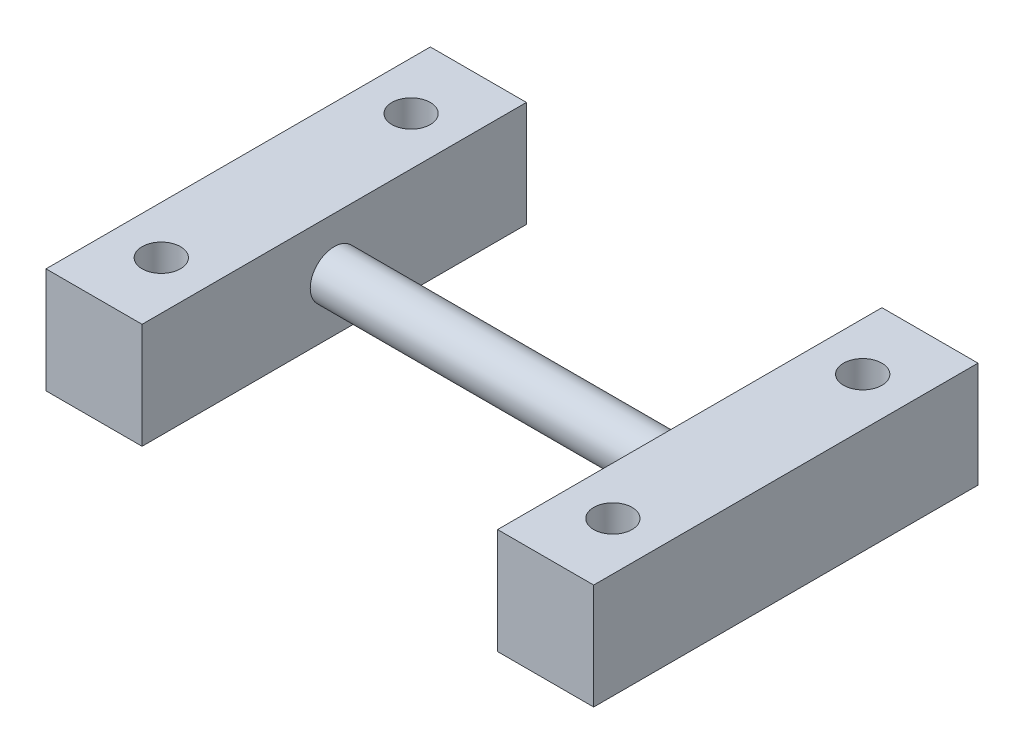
ISO-10303-21;
HEADER;
FILE_DESCRIPTION(('STEP AP214'),'2;1');
FILE_NAME('part.step','',(''),(''),'','','');
FILE_SCHEMA(('AUTOMOTIVE_DESIGN { 1 0 10303 214 1 1 1 1 }'));
ENDSEC;
DATA;
#1=APPLICATION_CONTEXT('core data for automotive mechanical design processes');
#2=APPLICATION_PROTOCOL_DEFINITION('international standard','automotive_design',2000,#1);
#3=PRODUCT_CONTEXT('',#1,'mechanical');
#4=PRODUCT('Part','Part','',(#3));
#5=PRODUCT_RELATED_PRODUCT_CATEGORY('part','',(#4));
#6=PRODUCT_DEFINITION_FORMATION('','',#4);
#7=PRODUCT_DEFINITION_CONTEXT('part definition',#1,'design');
#8=PRODUCT_DEFINITION('design','',#6,#7);
#9=PRODUCT_DEFINITION_SHAPE('','',#8);
#10=(LENGTH_UNIT() NAMED_UNIT(*) SI_UNIT(.MILLI.,.METRE.));
#11=(NAMED_UNIT(*) PLANE_ANGLE_UNIT() SI_UNIT($,.RADIAN.));
#12=(NAMED_UNIT(*) SI_UNIT($,.STERADIAN.) SOLID_ANGLE_UNIT());
#13=UNCERTAINTY_MEASURE_WITH_UNIT(LENGTH_MEASURE(1.E-05),#10,'distance_accuracy_value','');
#14=(GEOMETRIC_REPRESENTATION_CONTEXT(3) GLOBAL_UNCERTAINTY_ASSIGNED_CONTEXT((#13)) GLOBAL_UNIT_ASSIGNED_CONTEXT((#10,
#11,#12)) REPRESENTATION_CONTEXT('',''));
#15=CARTESIAN_POINT('',(0.,0.,0.));
#16=DIRECTION('',(0.,0.,1.));
#17=DIRECTION('',(1.,0.,0.));
#18=AXIS2_PLACEMENT_3D('',#15,#16,#17);
#19=CARTESIAN_POINT('',(0.,22.,0.));
#20=DIRECTION('',(1.,0.,0.));
#21=DIRECTION('',(0.,0.,-1.));
#22=AXIS2_PLACEMENT_3D('',#19,#20,#21);
#23=PLANE('',#22);
#24=DIRECTION('',(0.,0.,-1.));
#25=VECTOR('',#24,1.);
#26=CARTESIAN_POINT('',(0.,11.,40.));
#27=LINE('',#26,#25);
#28=CARTESIAN_POINT('',(0.,11.,40.));
#29=VERTEX_POINT('',#28);
#30=CARTESIAN_POINT('',(0.,11.,0.));
#31=VERTEX_POINT('',#30);
#32=EDGE_CURVE('E51',#29,#31,#27,.T.);
#33=ORIENTED_EDGE('',*,*,#32,.F.);
#34=DIRECTION('',(0.,-1.,0.));
#35=VECTOR('',#34,1.);
#36=CARTESIAN_POINT('',(0.,22.,40.));
#37=LINE('',#36,#35);
#38=CARTESIAN_POINT('',(0.,22.,40.));
#39=VERTEX_POINT('',#38);
#40=EDGE_CURVE('E44',#39,#29,#37,.T.);
#41=ORIENTED_EDGE('',*,*,#40,.F.);
#42=DIRECTION('',(0.,0.,1.));
#43=VECTOR('',#42,1.);
#44=CARTESIAN_POINT('',(0.,22.,0.));
#45=LINE('',#44,#43);
#46=CARTESIAN_POINT('',(0.,22.,0.));
#47=VERTEX_POINT('',#46);
#48=EDGE_CURVE('E140',#47,#39,#45,.T.);
#49=ORIENTED_EDGE('',*,*,#48,.F.);
#50=DIRECTION('',(0.,-1.,0.));
#51=VECTOR('',#50,1.);
#52=CARTESIAN_POINT('',(0.,22.,0.));
#53=LINE('',#52,#51);
#54=EDGE_CURVE('E149',#47,#31,#53,.T.);
#55=ORIENTED_EDGE('',*,*,#54,.T.);
#56=EDGE_LOOP('',(#33,#41,#49,#55));
#57=FACE_BOUND('',#56,.T.);
#58=ADVANCED_FACE('F36',(#57),#23,.F.);
#59=CARTESIAN_POINT('',(0.,22.,40.));
#60=DIRECTION('',(0.,0.,-1.));
#61=DIRECTION('',(-1.,0.,0.));
#62=AXIS2_PLACEMENT_3D('',#59,#60,#61);
#63=PLANE('',#62);
#64=DIRECTION('',(-1.,0.,0.));
#65=VECTOR('',#64,1.);
#66=CARTESIAN_POINT('',(0.,11.,40.));
#67=LINE('',#66,#65);
#68=CARTESIAN_POINT('',(10.,11.,40.));
#69=VERTEX_POINT('',#68);
#70=EDGE_CURVE('E118',#69,#29,#67,.T.);
#71=ORIENTED_EDGE('',*,*,#70,.F.);
#72=DIRECTION('',(0.,-1.,0.));
#73=VECTOR('',#72,1.);
#74=CARTESIAN_POINT('',(10.,22.,40.));
#75=LINE('',#74,#73);
#76=CARTESIAN_POINT('',(10.,22.,40.));
#77=VERTEX_POINT('',#76);
#78=EDGE_CURVE('E155',#77,#69,#75,.T.);
#79=ORIENTED_EDGE('',*,*,#78,.F.);
#80=DIRECTION('',(1.,0.,0.));
#81=VECTOR('',#80,1.);
#82=CARTESIAN_POINT('',(0.,22.,40.));
#83=LINE('',#82,#81);
#84=EDGE_CURVE('E143',#39,#77,#83,.T.);
#85=ORIENTED_EDGE('',*,*,#84,.F.);
#86=ORIENTED_EDGE('',*,*,#40,.T.);
#87=EDGE_LOOP('',(#71,#79,#85,#86));
#88=FACE_BOUND('',#87,.T.);
#89=ADVANCED_FACE('F162',(#88),#63,.F.);
#90=CARTESIAN_POINT('',(10.,22.,0.));
#91=DIRECTION('',(-1.,0.,0.));
#92=DIRECTION('',(0.,0.,1.));
#93=AXIS2_PLACEMENT_3D('',#90,#91,#92);
#94=PLANE('',#93);
#95=CARTESIAN_POINT('',(10.,16.5,20.));
#96=DIRECTION('',(-1.,0.,0.));
#97=DIRECTION('',(0.,0.,1.));
#98=AXIS2_PLACEMENT_3D('',#95,#96,#97);
#99=CIRCLE('',#98,2.5);
#100=CARTESIAN_POINT('',(10.,16.5,22.5));
#101=VERTEX_POINT('',#100);
#102=EDGE_CURVE('E11',#101,#101,#99,.F.);
#103=ORIENTED_EDGE('',*,*,#102,.F.);
#104=EDGE_LOOP('',(#103));
#105=FACE_BOUND('',#104,.T.);
#106=DIRECTION('',(0.,0.,1.));
#107=VECTOR('',#106,1.);
#108=CARTESIAN_POINT('',(10.,11.,0.));
#109=LINE('',#108,#107);
#110=CARTESIAN_POINT('',(10.,11.,0.));
#111=VERTEX_POINT('',#110);
#112=EDGE_CURVE('E181',#111,#69,#109,.T.);
#113=ORIENTED_EDGE('',*,*,#112,.F.);
#114=DIRECTION('',(0.,-1.,0.));
#115=VECTOR('',#114,1.);
#116=CARTESIAN_POINT('',(10.,22.,0.));
#117=LINE('',#116,#115);
#118=CARTESIAN_POINT('',(10.,22.,0.));
#119=VERTEX_POINT('',#118);
#120=EDGE_CURVE('E152',#119,#111,#117,.T.);
#121=ORIENTED_EDGE('',*,*,#120,.F.);
#122=DIRECTION('',(0.,0.,-1.));
#123=VECTOR('',#122,1.);
#124=CARTESIAN_POINT('',(10.,22.,0.));
#125=LINE('',#124,#123);
#126=EDGE_CURVE('E145',#77,#119,#125,.T.);
#127=ORIENTED_EDGE('',*,*,#126,.F.);
#128=ORIENTED_EDGE('',*,*,#78,.T.);
#129=EDGE_LOOP('',(#113,#121,#127,#128));
#130=FACE_BOUND('',#129,.T.);
#131=ADVANCED_FACE('F218',(#105,#130),#94,.F.);
#132=CARTESIAN_POINT('',(0.,22.,0.));
#133=DIRECTION('',(0.,0.,1.));
#134=DIRECTION('',(1.,0.,0.));
#135=AXIS2_PLACEMENT_3D('',#132,#133,#134);
#136=PLANE('',#135);
#137=DIRECTION('',(1.,0.,0.));
#138=VECTOR('',#137,1.);
#139=CARTESIAN_POINT('',(0.,11.,0.));
#140=LINE('',#139,#138);
#141=EDGE_CURVE('E107',#31,#111,#140,.T.);
#142=ORIENTED_EDGE('',*,*,#141,.F.);
#143=ORIENTED_EDGE('',*,*,#54,.F.);
#144=DIRECTION('',(-1.,0.,0.));
#145=VECTOR('',#144,1.);
#146=CARTESIAN_POINT('',(0.,22.,0.));
#147=LINE('',#146,#145);
#148=EDGE_CURVE('E147',#119,#47,#147,.T.);
#149=ORIENTED_EDGE('',*,*,#148,.F.);
#150=ORIENTED_EDGE('',*,*,#120,.T.);
#151=EDGE_LOOP('',(#142,#143,#149,#150));
#152=FACE_BOUND('',#151,.T.);
#153=ADVANCED_FACE('F222',(#152),#136,.F.);
#154=CARTESIAN_POINT('',(5.,22.,7.));
#155=DIRECTION('',(0.,-1.,0.));
#156=DIRECTION('',(0.,0.,-1.));
#157=AXIS2_PLACEMENT_3D('',#154,#155,#156);
#158=CYLINDRICAL_SURFACE('',#157,2.);
#159=CARTESIAN_POINT('',(5.,22.,7.));
#160=DIRECTION('',(0.,1.,0.));
#161=DIRECTION('',(0.,0.,1.));
#162=AXIS2_PLACEMENT_3D('',#159,#160,#161);
#163=CIRCLE('',#162,2.);
#164=CARTESIAN_POINT('',(5.,22.,9.));
#165=VERTEX_POINT('',#164);
#166=EDGE_CURVE('E137',#165,#165,#163,.T.);
#167=ORIENTED_EDGE('',*,*,#166,.T.);
#168=EDGE_LOOP('',(#167));
#169=FACE_BOUND('',#168,.T.);
#170=CARTESIAN_POINT('',(5.,11.,7.));
#171=DIRECTION('',(0.,-1.,0.));
#172=DIRECTION('',(0.,0.,-1.));
#173=AXIS2_PLACEMENT_3D('',#170,#171,#172);
#174=CIRCLE('',#173,2.);
#175=CARTESIAN_POINT('',(5.,11.,5.));
#176=VERTEX_POINT('',#175);
#177=EDGE_CURVE('E178',#176,#176,#174,.T.);
#178=ORIENTED_EDGE('',*,*,#177,.T.);
#179=EDGE_LOOP('',(#178));
#180=FACE_BOUND('',#179,.T.);
#181=ADVANCED_FACE('F228',(#169,#180),#158,.F.);
#182=CARTESIAN_POINT('',(5.,22.,33.));
#183=DIRECTION('',(0.,-1.,0.));
#184=DIRECTION('',(0.,0.,-1.));
#185=AXIS2_PLACEMENT_3D('',#182,#183,#184);
#186=CYLINDRICAL_SURFACE('',#185,2.);
#187=CARTESIAN_POINT('',(5.,22.,33.));
#188=DIRECTION('',(0.,1.,0.));
#189=DIRECTION('',(0.,0.,1.));
#190=AXIS2_PLACEMENT_3D('',#187,#188,#189);
#191=CIRCLE('',#190,2.);
#192=CARTESIAN_POINT('',(5.,22.,35.));
#193=VERTEX_POINT('',#192);
#194=EDGE_CURVE('E134',#193,#193,#191,.T.);
#195=ORIENTED_EDGE('',*,*,#194,.T.);
#196=EDGE_LOOP('',(#195));
#197=FACE_BOUND('',#196,.T.);
#198=CARTESIAN_POINT('',(5.,11.,33.));
#199=DIRECTION('',(0.,-1.,0.));
#200=DIRECTION('',(0.,0.,-1.));
#201=AXIS2_PLACEMENT_3D('',#198,#199,#200);
#202=CIRCLE('',#201,2.);
#203=CARTESIAN_POINT('',(5.,11.,31.));
#204=VERTEX_POINT('',#203);
#205=EDGE_CURVE('E175',#204,#204,#202,.T.);
#206=ORIENTED_EDGE('',*,*,#205,.T.);
#207=EDGE_LOOP('',(#206));
#208=FACE_BOUND('',#207,.T.);
#209=ADVANCED_FACE('F211',(#197,#208),#186,.F.);
#210=CARTESIAN_POINT('',(47.,22.,0.));
#211=DIRECTION('',(1.,0.,0.));
#212=DIRECTION('',(0.,0.,-1.));
#213=AXIS2_PLACEMENT_3D('',#210,#211,#212);
#214=PLANE('',#213);
#215=CARTESIAN_POINT('',(47.,16.5,20.));
#216=DIRECTION('',(1.,0.,0.));
#217=DIRECTION('',(0.,0.,-1.));
#218=AXIS2_PLACEMENT_3D('',#215,#216,#217);
#219=CIRCLE('',#218,2.5);
#220=CARTESIAN_POINT('',(47.,16.5,17.5));
#221=VERTEX_POINT('',#220);
#222=EDGE_CURVE('E131',#221,#221,#219,.T.);
#223=ORIENTED_EDGE('',*,*,#222,.T.);
#224=EDGE_LOOP('',(#223));
#225=FACE_BOUND('',#224,.T.);
#226=DIRECTION('',(0.,0.,-1.));
#227=VECTOR('',#226,1.);
#228=CARTESIAN_POINT('',(47.,11.,0.));
#229=LINE('',#228,#227);
#230=CARTESIAN_POINT('',(47.,11.,40.));
#231=VERTEX_POINT('',#230);
#232=CARTESIAN_POINT('',(47.,11.,0.));
#233=VERTEX_POINT('',#232);
#234=EDGE_CURVE('E59',#231,#233,#229,.T.);
#235=ORIENTED_EDGE('',*,*,#234,.F.);
#236=DIRECTION('',(0.,-1.,0.));
#237=VECTOR('',#236,1.);
#238=CARTESIAN_POINT('',(47.,22.,40.));
#239=LINE('',#238,#237);
#240=CARTESIAN_POINT('',(47.,22.,40.));
#241=VERTEX_POINT('',#240);
#242=EDGE_CURVE('E124',#241,#231,#239,.T.);
#243=ORIENTED_EDGE('',*,*,#242,.F.);
#244=DIRECTION('',(0.,0.,1.));
#245=VECTOR('',#244,1.);
#246=CARTESIAN_POINT('',(47.,22.,0.));
#247=LINE('',#246,#245);
#248=CARTESIAN_POINT('',(47.,22.,0.));
#249=VERTEX_POINT('',#248);
#250=EDGE_CURVE('E189',#249,#241,#247,.T.);
#251=ORIENTED_EDGE('',*,*,#250,.F.);
#252=DIRECTION('',(0.,-1.,0.));
#253=VECTOR('',#252,1.);
#254=CARTESIAN_POINT('',(47.,22.,0.));
#255=LINE('',#254,#253);
#256=EDGE_CURVE('E122',#249,#233,#255,.T.);
#257=ORIENTED_EDGE('',*,*,#256,.T.);
#258=EDGE_LOOP('',(#235,#243,#251,#257));
#259=FACE_BOUND('',#258,.T.);
#260=ADVANCED_FACE('F201',(#225,#259),#214,.F.);
#261=CARTESIAN_POINT('',(47.,22.,40.));
#262=DIRECTION('',(0.,0.,-1.));
#263=DIRECTION('',(-1.,0.,0.));
#264=AXIS2_PLACEMENT_3D('',#261,#262,#263);
#265=PLANE('',#264);
#266=CARTESIAN_POINT('',(57.,11.,40.));
#267=VERTEX_POINT('',#266);
#268=EDGE_CURVE('E169',#267,#231,#67,.T.);
#269=ORIENTED_EDGE('',*,*,#268,.F.);
#270=DIRECTION('',(0.,-1.,0.));
#271=VECTOR('',#270,1.);
#272=CARTESIAN_POINT('',(57.,22.,40.));
#273=LINE('',#272,#271);
#274=CARTESIAN_POINT('',(57.,22.,40.));
#275=VERTEX_POINT('',#274);
#276=EDGE_CURVE('E117',#275,#267,#273,.T.);
#277=ORIENTED_EDGE('',*,*,#276,.F.);
#278=DIRECTION('',(1.,0.,0.));
#279=VECTOR('',#278,1.);
#280=CARTESIAN_POINT('',(47.,22.,40.));
#281=LINE('',#280,#279);
#282=EDGE_CURVE('E192',#241,#275,#281,.T.);
#283=ORIENTED_EDGE('',*,*,#282,.F.);
#284=ORIENTED_EDGE('',*,*,#242,.T.);
#285=EDGE_LOOP('',(#269,#277,#283,#284));
#286=FACE_BOUND('',#285,.T.);
#287=ADVANCED_FACE('F203',(#286),#265,.F.);
#288=CARTESIAN_POINT('',(57.,22.,0.));
#289=DIRECTION('',(-1.,0.,0.));
#290=DIRECTION('',(0.,0.,1.));
#291=AXIS2_PLACEMENT_3D('',#288,#289,#290);
#292=PLANE('',#291);
#293=DIRECTION('',(0.,0.,1.));
#294=VECTOR('',#293,1.);
#295=CARTESIAN_POINT('',(57.,11.,40.));
#296=LINE('',#295,#294);
#297=CARTESIAN_POINT('',(57.,11.,0.));
#298=VERTEX_POINT('',#297);
#299=EDGE_CURVE('E101',#298,#267,#296,.T.);
#300=ORIENTED_EDGE('',*,*,#299,.F.);
#301=DIRECTION('',(0.,-1.,0.));
#302=VECTOR('',#301,1.);
#303=CARTESIAN_POINT('',(57.,22.,0.));
#304=LINE('',#303,#302);
#305=CARTESIAN_POINT('',(57.,22.,0.));
#306=VERTEX_POINT('',#305);
#307=EDGE_CURVE('E114',#306,#298,#304,.T.);
#308=ORIENTED_EDGE('',*,*,#307,.F.);
#309=DIRECTION('',(0.,0.,-1.));
#310=VECTOR('',#309,1.);
#311=CARTESIAN_POINT('',(57.,22.,0.));
#312=LINE('',#311,#310);
#313=EDGE_CURVE('E194',#275,#306,#312,.T.);
#314=ORIENTED_EDGE('',*,*,#313,.F.);
#315=ORIENTED_EDGE('',*,*,#276,.T.);
#316=EDGE_LOOP('',(#300,#308,#314,#315));
#317=FACE_BOUND('',#316,.T.);
#318=ADVANCED_FACE('F112',(#317),#292,.F.);
#319=CARTESIAN_POINT('',(47.,22.,0.));
#320=DIRECTION('',(0.,0.,1.));
#321=DIRECTION('',(1.,0.,0.));
#322=AXIS2_PLACEMENT_3D('',#319,#320,#321);
#323=PLANE('',#322);
#324=EDGE_CURVE('E98',#233,#298,#140,.T.);
#325=ORIENTED_EDGE('',*,*,#324,.F.);
#326=ORIENTED_EDGE('',*,*,#256,.F.);
#327=DIRECTION('',(-1.,0.,0.));
#328=VECTOR('',#327,1.);
#329=CARTESIAN_POINT('',(47.,22.,0.));
#330=LINE('',#329,#328);
#331=EDGE_CURVE('E121',#306,#249,#330,.T.);
#332=ORIENTED_EDGE('',*,*,#331,.F.);
#333=ORIENTED_EDGE('',*,*,#307,.T.);
#334=EDGE_LOOP('',(#325,#326,#332,#333));
#335=FACE_BOUND('',#334,.T.);
#336=ADVANCED_FACE('F120',(#335),#323,.F.);
#337=CARTESIAN_POINT('',(52.,22.,7.));
#338=DIRECTION('',(0.,-1.,0.));
#339=DIRECTION('',(0.,0.,-1.));
#340=AXIS2_PLACEMENT_3D('',#337,#338,#339);
#341=CYLINDRICAL_SURFACE('',#340,2.);
#342=CARTESIAN_POINT('',(52.,22.,7.));
#343=DIRECTION('',(0.,1.,0.));
#344=DIRECTION('',(0.,0.,1.));
#345=AXIS2_PLACEMENT_3D('',#342,#343,#344);
#346=CIRCLE('',#345,2.);
#347=CARTESIAN_POINT('',(52.,22.,9.));
#348=VERTEX_POINT('',#347);
#349=EDGE_CURVE('E186',#348,#348,#346,.T.);
#350=ORIENTED_EDGE('',*,*,#349,.T.);
#351=EDGE_LOOP('',(#350));
#352=FACE_BOUND('',#351,.T.);
#353=CARTESIAN_POINT('',(52.,11.,7.));
#354=DIRECTION('',(0.,-1.,0.));
#355=DIRECTION('',(0.,0.,-1.));
#356=AXIS2_PLACEMENT_3D('',#353,#354,#355);
#357=CIRCLE('',#356,2.);
#358=CARTESIAN_POINT('',(52.,11.,5.00000000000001));
#359=VERTEX_POINT('',#358);
#360=EDGE_CURVE('E171',#359,#359,#357,.T.);
#361=ORIENTED_EDGE('',*,*,#360,.T.);
#362=EDGE_LOOP('',(#361));
#363=FACE_BOUND('',#362,.T.);
#364=ADVANCED_FACE('F276',(#352,#363),#341,.F.);
#365=CARTESIAN_POINT('',(52.,22.,33.));
#366=DIRECTION('',(0.,-1.,0.));
#367=DIRECTION('',(0.,0.,-1.));
#368=AXIS2_PLACEMENT_3D('',#365,#366,#367);
#369=CYLINDRICAL_SURFACE('',#368,2.);
#370=CARTESIAN_POINT('',(52.,22.,33.));
#371=DIRECTION('',(0.,1.,0.));
#372=DIRECTION('',(0.,0.,1.));
#373=AXIS2_PLACEMENT_3D('',#370,#371,#372);
#374=CIRCLE('',#373,2.);
#375=CARTESIAN_POINT('',(52.,22.,35.));
#376=VERTEX_POINT('',#375);
#377=EDGE_CURVE('E183',#376,#376,#374,.T.);
#378=ORIENTED_EDGE('',*,*,#377,.T.);
#379=EDGE_LOOP('',(#378));
#380=FACE_BOUND('',#379,.T.);
#381=CARTESIAN_POINT('',(52.,11.,33.));
#382=DIRECTION('',(0.,-1.,0.));
#383=DIRECTION('',(0.,0.,-1.));
#384=AXIS2_PLACEMENT_3D('',#381,#382,#383);
#385=CIRCLE('',#384,2.);
#386=CARTESIAN_POINT('',(52.,11.,31.));
#387=VERTEX_POINT('',#386);
#388=EDGE_CURVE('E39',#387,#387,#385,.T.);
#389=ORIENTED_EDGE('',*,*,#388,.T.);
#390=EDGE_LOOP('',(#389));
#391=FACE_BOUND('',#390,.T.);
#392=ADVANCED_FACE('F234',(#380,#391),#369,.F.);
#393=CARTESIAN_POINT('',(0.,22.,0.));
#394=DIRECTION('',(0.,1.,0.));
#395=DIRECTION('',(0.,0.,1.));
#396=AXIS2_PLACEMENT_3D('',#393,#394,#395);
#397=PLANE('',#396);
#398=ORIENTED_EDGE('',*,*,#166,.F.);
#399=EDGE_LOOP('',(#398));
#400=FACE_BOUND('',#399,.T.);
#401=ORIENTED_EDGE('',*,*,#48,.T.);
#402=ORIENTED_EDGE('',*,*,#84,.T.);
#403=ORIENTED_EDGE('',*,*,#126,.T.);
#404=ORIENTED_EDGE('',*,*,#148,.T.);
#405=EDGE_LOOP('',(#401,#402,#403,#404));
#406=FACE_BOUND('',#405,.T.);
#407=ORIENTED_EDGE('',*,*,#194,.F.);
#408=EDGE_LOOP('',(#407));
#409=FACE_BOUND('',#408,.T.);
#410=ADVANCED_FACE('F230',(#400,#406,#409),#397,.T.);
#411=CARTESIAN_POINT('',(57.002,16.5,20.));
#412=DIRECTION('',(-1.,0.,0.));
#413=DIRECTION('',(0.,0.,1.));
#414=AXIS2_PLACEMENT_3D('',#411,#412,#413);
#415=CYLINDRICAL_SURFACE('',#414,2.5);
#416=ORIENTED_EDGE('',*,*,#102,.T.);
#417=EDGE_LOOP('',(#416));
#418=FACE_BOUND('',#417,.T.);
#419=ORIENTED_EDGE('',*,*,#222,.F.);
#420=EDGE_LOOP('',(#419));
#421=FACE_BOUND('',#420,.T.);
#422=ADVANCED_FACE('F233',(#418,#421),#415,.T.);
#423=CARTESIAN_POINT('',(0.,22.,0.));
#424=DIRECTION('',(0.,1.,0.));
#425=DIRECTION('',(0.,0.,1.));
#426=AXIS2_PLACEMENT_3D('',#423,#424,#425);
#427=PLANE('',#426);
#428=ORIENTED_EDGE('',*,*,#349,.F.);
#429=EDGE_LOOP('',(#428));
#430=FACE_BOUND('',#429,.T.);
#431=ORIENTED_EDGE('',*,*,#250,.T.);
#432=ORIENTED_EDGE('',*,*,#282,.T.);
#433=ORIENTED_EDGE('',*,*,#313,.T.);
#434=ORIENTED_EDGE('',*,*,#331,.T.);
#435=EDGE_LOOP('',(#431,#432,#433,#434));
#436=FACE_BOUND('',#435,.T.);
#437=ORIENTED_EDGE('',*,*,#377,.F.);
#438=EDGE_LOOP('',(#437));
#439=FACE_BOUND('',#438,.T.);
#440=ADVANCED_FACE('F196',(#430,#436,#439),#427,.T.);
#441=CARTESIAN_POINT('',(0.,11.,0.));
#442=DIRECTION('',(0.,-1.,0.));
#443=DIRECTION('',(0.,0.,-1.));
#444=AXIS2_PLACEMENT_3D('',#441,#442,#443);
#445=PLANE('',#444);
#446=ORIENTED_EDGE('',*,*,#388,.F.);
#447=EDGE_LOOP('',(#446));
#448=FACE_BOUND('',#447,.T.);
#449=ORIENTED_EDGE('',*,*,#360,.F.);
#450=EDGE_LOOP('',(#449));
#451=FACE_BOUND('',#450,.T.);
#452=ORIENTED_EDGE('',*,*,#234,.T.);
#453=ORIENTED_EDGE('',*,*,#324,.T.);
#454=ORIENTED_EDGE('',*,*,#299,.T.);
#455=ORIENTED_EDGE('',*,*,#268,.T.);
#456=EDGE_LOOP('',(#452,#453,#454,#455));
#457=FACE_BOUND('',#456,.T.);
#458=ADVANCED_FACE('F100',(#448,#451,#457),#445,.T.);
#459=ORIENTED_EDGE('',*,*,#205,.F.);
#460=EDGE_LOOP('',(#459));
#461=FACE_BOUND('',#460,.T.);
#462=ORIENTED_EDGE('',*,*,#177,.F.);
#463=EDGE_LOOP('',(#462));
#464=FACE_BOUND('',#463,.T.);
#465=ORIENTED_EDGE('',*,*,#112,.T.);
#466=ORIENTED_EDGE('',*,*,#70,.T.);
#467=ORIENTED_EDGE('',*,*,#32,.T.);
#468=ORIENTED_EDGE('',*,*,#141,.T.);
#469=EDGE_LOOP('',(#465,#466,#467,#468));
#470=FACE_BOUND('',#469,.T.);
#471=ADVANCED_FACE('F263',(#461,#464,#470),#445,.T.);
#472=CLOSED_SHELL('',(#58,#89,#131,#153,#181,#209,#260,#287,#318,#336,#364,#392,#410,#422,#440,
#458,#471));
#473=MANIFOLD_SOLID_BREP('B2',#472);
#474=ADVANCED_BREP_SHAPE_REPRESENTATION('',(#18,#473),#14);
#475=SHAPE_DEFINITION_REPRESENTATION(#9,#474);
ENDSEC;
END-ISO-10303-21;
